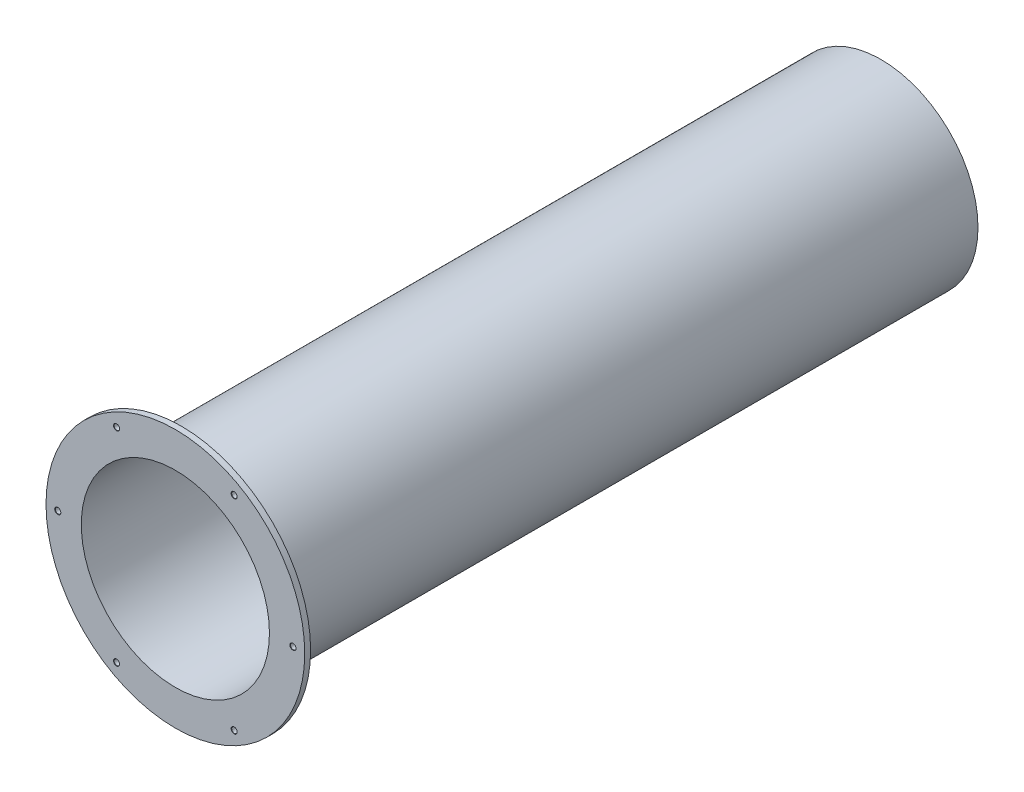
ISO-10303-21;
HEADER;
FILE_DESCRIPTION(('STEP AP214'),'2;1');
FILE_NAME('part.step','',(''),(''),'','','');
FILE_SCHEMA(('AUTOMOTIVE_DESIGN { 1 0 10303 214 1 1 1 1 }'));
ENDSEC;
DATA;
#1=APPLICATION_CONTEXT('core data for automotive mechanical design processes');
#2=APPLICATION_PROTOCOL_DEFINITION('international standard','automotive_design',2000,#1);
#3=PRODUCT_CONTEXT('',#1,'mechanical');
#4=PRODUCT('Part','Part','',(#3));
#5=PRODUCT_RELATED_PRODUCT_CATEGORY('part','',(#4));
#6=PRODUCT_DEFINITION_FORMATION('','',#4);
#7=PRODUCT_DEFINITION_CONTEXT('part definition',#1,'design');
#8=PRODUCT_DEFINITION('design','',#6,#7);
#9=PRODUCT_DEFINITION_SHAPE('','',#8);
#10=(LENGTH_UNIT() NAMED_UNIT(*) SI_UNIT(.MILLI.,.METRE.));
#11=(NAMED_UNIT(*) PLANE_ANGLE_UNIT() SI_UNIT($,.RADIAN.));
#12=(NAMED_UNIT(*) SI_UNIT($,.STERADIAN.) SOLID_ANGLE_UNIT());
#13=UNCERTAINTY_MEASURE_WITH_UNIT(LENGTH_MEASURE(1.E-05),#10,'distance_accuracy_value','');
#14=(GEOMETRIC_REPRESENTATION_CONTEXT(3) GLOBAL_UNCERTAINTY_ASSIGNED_CONTEXT((#13)) GLOBAL_UNIT_ASSIGNED_CONTEXT((#10,
#11,#12)) REPRESENTATION_CONTEXT('',''));
#15=CARTESIAN_POINT('',(0.,0.,0.));
#16=DIRECTION('',(0.,0.,1.));
#17=DIRECTION('',(1.,0.,0.));
#18=AXIS2_PLACEMENT_3D('',#15,#16,#17);
#19=CARTESIAN_POINT('',(0.,0.,12.7));
#20=DIRECTION('',(0.,0.,1.));
#21=DIRECTION('',(1.,0.,0.));
#22=AXIS2_PLACEMENT_3D('',#19,#20,#21);
#23=PLANE('',#22);
#24=CARTESIAN_POINT('',(254.,0.,12.7));
#25=DIRECTION('',(0.,0.,1.));
#26=DIRECTION('',(1.,0.,0.));
#27=AXIS2_PLACEMENT_3D('',#24,#25,#26);
#28=CIRCLE('',#27,6.588125);
#29=CARTESIAN_POINT('',(260.588125,0.,12.7));
#30=VERTEX_POINT('',#29);
#31=EDGE_CURVE('E123',#30,#30,#28,.T.);
#32=ORIENTED_EDGE('',*,*,#31,.F.);
#33=EDGE_LOOP('',(#32));
#34=FACE_BOUND('',#33,.T.);
#35=CARTESIAN_POINT('',(127.,-219.970452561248,12.7));
#36=DIRECTION('',(0.,0.,1.));
#37=DIRECTION('',(1.,0.,0.));
#38=AXIS2_PLACEMENT_3D('',#35,#36,#37);
#39=CIRCLE('',#38,6.588125);
#40=CARTESIAN_POINT('',(133.588125,-219.970452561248,12.7));
#41=VERTEX_POINT('',#40);
#42=EDGE_CURVE('E111',#41,#41,#39,.T.);
#43=ORIENTED_EDGE('',*,*,#42,.F.);
#44=EDGE_LOOP('',(#43));
#45=FACE_BOUND('',#44,.T.);
#46=CARTESIAN_POINT('',(-127.000000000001,-219.970452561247,12.7));
#47=DIRECTION('',(0.,0.,1.));
#48=DIRECTION('',(1.,0.,0.));
#49=AXIS2_PLACEMENT_3D('',#46,#47,#48);
#50=CIRCLE('',#49,6.588125);
#51=CARTESIAN_POINT('',(-120.411875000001,-219.970452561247,12.7));
#52=VERTEX_POINT('',#51);
#53=EDGE_CURVE('E99',#52,#52,#50,.T.);
#54=ORIENTED_EDGE('',*,*,#53,.F.);
#55=EDGE_LOOP('',(#54));
#56=FACE_BOUND('',#55,.T.);
#57=CARTESIAN_POINT('',(-254.,1.77367252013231E-12,12.7));
#58=DIRECTION('',(0.,0.,1.));
#59=DIRECTION('',(1.,0.,0.));
#60=AXIS2_PLACEMENT_3D('',#57,#58,#59);
#61=CIRCLE('',#60,6.588125);
#62=CARTESIAN_POINT('',(-247.411875,1.77367252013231E-12,12.7));
#63=VERTEX_POINT('',#62);
#64=EDGE_CURVE('E87',#63,#63,#61,.T.);
#65=ORIENTED_EDGE('',*,*,#64,.F.);
#66=EDGE_LOOP('',(#65));
#67=FACE_BOUND('',#66,.T.);
#68=CARTESIAN_POINT('',(-126.999999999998,219.970452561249,12.7));
#69=DIRECTION('',(0.,0.,1.));
#70=DIRECTION('',(1.,0.,0.));
#71=AXIS2_PLACEMENT_3D('',#68,#69,#70);
#72=CIRCLE('',#71,6.588125);
#73=CARTESIAN_POINT('',(-120.411874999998,219.970452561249,12.7));
#74=VERTEX_POINT('',#73);
#75=EDGE_CURVE('E75',#74,#74,#72,.T.);
#76=ORIENTED_EDGE('',*,*,#75,.F.);
#77=EDGE_LOOP('',(#76));
#78=FACE_BOUND('',#77,.T.);
#79=CARTESIAN_POINT('',(127.000000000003,219.970452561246,12.7));
#80=DIRECTION('',(0.,0.,1.));
#81=DIRECTION('',(1.,0.,0.));
#82=AXIS2_PLACEMENT_3D('',#79,#80,#81);
#83=CIRCLE('',#82,6.588125);
#84=CARTESIAN_POINT('',(133.588125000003,219.970452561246,12.7));
#85=VERTEX_POINT('',#84);
#86=EDGE_CURVE('E63',#85,#85,#83,.T.);
#87=ORIENTED_EDGE('',*,*,#86,.F.);
#88=EDGE_LOOP('',(#87));
#89=FACE_BOUND('',#88,.T.);
#90=CARTESIAN_POINT('',(0.,0.,12.7));
#91=DIRECTION('',(0.,0.,1.));
#92=DIRECTION('',(1.,0.,0.));
#93=AXIS2_PLACEMENT_3D('',#90,#91,#92);
#94=CIRCLE('',#93,279.4);
#95=CARTESIAN_POINT('',(279.4,0.,12.7));
#96=VERTEX_POINT('',#95);
#97=EDGE_CURVE('E10',#96,#96,#94,.T.);
#98=ORIENTED_EDGE('',*,*,#97,.T.);
#99=EDGE_LOOP('',(#98));
#100=FACE_BOUND('',#99,.T.);
#101=CARTESIAN_POINT('',(0.,0.,12.7));
#102=DIRECTION('',(0.,0.,1.));
#103=DIRECTION('',(1.,0.,0.));
#104=AXIS2_PLACEMENT_3D('',#101,#102,#103);
#105=CIRCLE('',#104,203.2);
#106=CARTESIAN_POINT('',(203.2,0.,12.7));
#107=VERTEX_POINT('',#106);
#108=EDGE_CURVE('E47',#107,#107,#105,.T.);
#109=ORIENTED_EDGE('',*,*,#108,.F.);
#110=EDGE_LOOP('',(#109));
#111=FACE_BOUND('',#110,.T.);
#112=ADVANCED_FACE('F34',(#34,#45,#56,#67,#78,#89,#100,#111),#23,.T.);
#113=CARTESIAN_POINT('',(0.,0.,0.));
#114=DIRECTION('',(0.,0.,1.));
#115=DIRECTION('',(1.,0.,0.));
#116=AXIS2_PLACEMENT_3D('',#113,#114,#115);
#117=PLANE('',#116);
#118=CARTESIAN_POINT('',(254.,0.,0.));
#119=DIRECTION('',(0.,0.,1.));
#120=DIRECTION('',(1.,0.,0.));
#121=AXIS2_PLACEMENT_3D('',#118,#119,#120);
#122=CIRCLE('',#121,6.588125);
#123=CARTESIAN_POINT('',(260.588125,0.,0.));
#124=VERTEX_POINT('',#123);
#125=EDGE_CURVE('E126',#124,#124,#122,.T.);
#126=ORIENTED_EDGE('',*,*,#125,.T.);
#127=EDGE_LOOP('',(#126));
#128=FACE_BOUND('',#127,.T.);
#129=CARTESIAN_POINT('',(127.,-219.970452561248,0.));
#130=DIRECTION('',(0.,0.,1.));
#131=DIRECTION('',(1.,0.,0.));
#132=AXIS2_PLACEMENT_3D('',#129,#130,#131);
#133=CIRCLE('',#132,6.588125);
#134=CARTESIAN_POINT('',(133.588125,-219.970452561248,0.));
#135=VERTEX_POINT('',#134);
#136=EDGE_CURVE('E114',#135,#135,#133,.T.);
#137=ORIENTED_EDGE('',*,*,#136,.T.);
#138=EDGE_LOOP('',(#137));
#139=FACE_BOUND('',#138,.T.);
#140=CARTESIAN_POINT('',(-127.000000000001,-219.970452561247,0.));
#141=DIRECTION('',(0.,0.,1.));
#142=DIRECTION('',(1.,0.,0.));
#143=AXIS2_PLACEMENT_3D('',#140,#141,#142);
#144=CIRCLE('',#143,6.588125);
#145=CARTESIAN_POINT('',(-120.411875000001,-219.970452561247,0.));
#146=VERTEX_POINT('',#145);
#147=EDGE_CURVE('E102',#146,#146,#144,.T.);
#148=ORIENTED_EDGE('',*,*,#147,.T.);
#149=EDGE_LOOP('',(#148));
#150=FACE_BOUND('',#149,.T.);
#151=CARTESIAN_POINT('',(-254.,1.77367252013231E-12,0.));
#152=DIRECTION('',(0.,0.,1.));
#153=DIRECTION('',(1.,0.,0.));
#154=AXIS2_PLACEMENT_3D('',#151,#152,#153);
#155=CIRCLE('',#154,6.588125);
#156=CARTESIAN_POINT('',(-247.411875,1.77367252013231E-12,0.));
#157=VERTEX_POINT('',#156);
#158=EDGE_CURVE('E90',#157,#157,#155,.T.);
#159=ORIENTED_EDGE('',*,*,#158,.T.);
#160=EDGE_LOOP('',(#159));
#161=FACE_BOUND('',#160,.T.);
#162=CARTESIAN_POINT('',(-126.999999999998,219.970452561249,0.));
#163=DIRECTION('',(0.,0.,1.));
#164=DIRECTION('',(1.,0.,0.));
#165=AXIS2_PLACEMENT_3D('',#162,#163,#164);
#166=CIRCLE('',#165,6.588125);
#167=CARTESIAN_POINT('',(-120.411874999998,219.970452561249,0.));
#168=VERTEX_POINT('',#167);
#169=EDGE_CURVE('E78',#168,#168,#166,.T.);
#170=ORIENTED_EDGE('',*,*,#169,.T.);
#171=EDGE_LOOP('',(#170));
#172=FACE_BOUND('',#171,.T.);
#173=CARTESIAN_POINT('',(127.000000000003,219.970452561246,0.));
#174=DIRECTION('',(0.,0.,1.));
#175=DIRECTION('',(1.,0.,0.));
#176=AXIS2_PLACEMENT_3D('',#173,#174,#175);
#177=CIRCLE('',#176,6.588125);
#178=CARTESIAN_POINT('',(133.588125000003,219.970452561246,0.));
#179=VERTEX_POINT('',#178);
#180=EDGE_CURVE('E66',#179,#179,#177,.T.);
#181=ORIENTED_EDGE('',*,*,#180,.T.);
#182=EDGE_LOOP('',(#181));
#183=FACE_BOUND('',#182,.T.);
#184=CARTESIAN_POINT('',(0.,0.,0.));
#185=DIRECTION('',(0.,0.,1.));
#186=DIRECTION('',(1.,0.,0.));
#187=AXIS2_PLACEMENT_3D('',#184,#185,#186);
#188=CIRCLE('',#187,209.55);
#189=CARTESIAN_POINT('',(209.55,0.,0.));
#190=VERTEX_POINT('',#189);
#191=EDGE_CURVE('E38',#190,#190,#188,.T.);
#192=ORIENTED_EDGE('',*,*,#191,.T.);
#193=EDGE_LOOP('',(#192));
#194=FACE_BOUND('',#193,.T.);
#195=CARTESIAN_POINT('',(0.,0.,0.));
#196=DIRECTION('',(0.,0.,1.));
#197=DIRECTION('',(1.,0.,0.));
#198=AXIS2_PLACEMENT_3D('',#195,#196,#197);
#199=CIRCLE('',#198,279.4);
#200=CARTESIAN_POINT('',(279.4,0.,0.));
#201=VERTEX_POINT('',#200);
#202=EDGE_CURVE('E42',#201,#201,#199,.T.);
#203=ORIENTED_EDGE('',*,*,#202,.F.);
#204=EDGE_LOOP('',(#203));
#205=FACE_BOUND('',#204,.T.);
#206=ADVANCED_FACE('F130',(#128,#139,#150,#161,#172,#183,#194,#205),#117,.F.);
#207=CARTESIAN_POINT('',(0.,0.,12.7));
#208=DIRECTION('',(0.,0.,-1.));
#209=DIRECTION('',(-1.,0.,0.));
#210=AXIS2_PLACEMENT_3D('',#207,#208,#209);
#211=CYLINDRICAL_SURFACE('',#210,279.4);
#212=ORIENTED_EDGE('',*,*,#97,.F.);
#213=EDGE_LOOP('',(#212));
#214=FACE_BOUND('',#213,.T.);
#215=ORIENTED_EDGE('',*,*,#202,.T.);
#216=EDGE_LOOP('',(#215));
#217=FACE_BOUND('',#216,.T.);
#218=ADVANCED_FACE('F36',(#214,#217),#211,.T.);
#219=CARTESIAN_POINT('',(0.,0.,12.7));
#220=DIRECTION('',(0.,0.,-1.));
#221=DIRECTION('',(-1.,0.,0.));
#222=AXIS2_PLACEMENT_3D('',#219,#220,#221);
#223=CYLINDRICAL_SURFACE('',#222,203.2);
#224=ORIENTED_EDGE('',*,*,#108,.T.);
#225=EDGE_LOOP('',(#224));
#226=FACE_BOUND('',#225,.T.);
#227=CARTESIAN_POINT('',(0.,0.,-1511.3));
#228=DIRECTION('',(0.,0.,1.));
#229=DIRECTION('',(1.,0.,0.));
#230=AXIS2_PLACEMENT_3D('',#227,#228,#229);
#231=CIRCLE('',#230,203.2);
#232=CARTESIAN_POINT('',(203.2,0.,-1511.3));
#233=VERTEX_POINT('',#232);
#234=EDGE_CURVE('E54',#233,#233,#231,.T.);
#235=ORIENTED_EDGE('',*,*,#234,.F.);
#236=EDGE_LOOP('',(#235));
#237=FACE_BOUND('',#236,.T.);
#238=ADVANCED_FACE('F167',(#226,#237),#223,.F.);
#239=CARTESIAN_POINT('',(0.,0.,-1511.3));
#240=DIRECTION('',(0.,0.,1.));
#241=DIRECTION('',(1.,0.,0.));
#242=AXIS2_PLACEMENT_3D('',#239,#240,#241);
#243=CYLINDRICAL_SURFACE('',#242,209.55);
#244=CARTESIAN_POINT('',(0.,0.,-1511.3));
#245=DIRECTION('',(0.,0.,1.));
#246=DIRECTION('',(1.,0.,0.));
#247=AXIS2_PLACEMENT_3D('',#244,#245,#246);
#248=CIRCLE('',#247,209.55);
#249=CARTESIAN_POINT('',(209.55,0.,-1511.3));
#250=VERTEX_POINT('',#249);
#251=EDGE_CURVE('E51',#250,#250,#248,.T.);
#252=ORIENTED_EDGE('',*,*,#251,.T.);
#253=EDGE_LOOP('',(#252));
#254=FACE_BOUND('',#253,.T.);
#255=ORIENTED_EDGE('',*,*,#191,.F.);
#256=EDGE_LOOP('',(#255));
#257=FACE_BOUND('',#256,.T.);
#258=ADVANCED_FACE('F170',(#254,#257),#243,.T.);
#259=CARTESIAN_POINT('',(0.,0.,-1511.3));
#260=DIRECTION('',(0.,0.,1.));
#261=DIRECTION('',(1.,0.,0.));
#262=AXIS2_PLACEMENT_3D('',#259,#260,#261);
#263=PLANE('',#262);
#264=ORIENTED_EDGE('',*,*,#234,.T.);
#265=EDGE_LOOP('',(#264));
#266=FACE_BOUND('',#265,.T.);
#267=ORIENTED_EDGE('',*,*,#251,.F.);
#268=EDGE_LOOP('',(#267));
#269=FACE_BOUND('',#268,.T.);
#270=ADVANCED_FACE('F174',(#266,#269),#263,.F.);
#271=CARTESIAN_POINT('',(127.000000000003,219.970452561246,0.635000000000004));
#272=DIRECTION('',(0.,0.,-1.));
#273=DIRECTION('',(-1.,0.,0.));
#274=AXIS2_PLACEMENT_3D('',#271,#272,#273);
#275=CONICAL_SURFACE('',#274,5.953125,0.785398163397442);
#276=ORIENTED_EDGE('',*,*,#180,.F.);
#277=EDGE_LOOP('',(#276));
#278=FACE_BOUND('',#277,.T.);
#279=CARTESIAN_POINT('',(127.000000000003,219.970452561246,0.635000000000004));
#280=DIRECTION('',(0.,0.,1.));
#281=DIRECTION('',(1.,0.,0.));
#282=AXIS2_PLACEMENT_3D('',#279,#280,#281);
#283=CIRCLE('',#282,5.953125);
#284=CARTESIAN_POINT('',(132.953125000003,219.970452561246,0.635000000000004));
#285=VERTEX_POINT('',#284);
#286=EDGE_CURVE('E57',#285,#285,#283,.T.);
#287=ORIENTED_EDGE('',*,*,#286,.T.);
#288=EDGE_LOOP('',(#287));
#289=FACE_BOUND('',#288,.T.);
#290=ADVANCED_FACE('F177',(#278,#289),#275,.F.);
#291=CARTESIAN_POINT('',(127.000000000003,219.970452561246,12.7));
#292=DIRECTION('',(0.,0.,1.));
#293=DIRECTION('',(1.,0.,0.));
#294=AXIS2_PLACEMENT_3D('',#291,#292,#293);
#295=CYLINDRICAL_SURFACE('',#294,5.953125);
#296=ORIENTED_EDGE('',*,*,#286,.F.);
#297=EDGE_LOOP('',(#296));
#298=FACE_BOUND('',#297,.T.);
#299=CARTESIAN_POINT('',(127.000000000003,219.970452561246,12.065));
#300=DIRECTION('',(0.,0.,1.));
#301=DIRECTION('',(1.,0.,0.));
#302=AXIS2_PLACEMENT_3D('',#299,#300,#301);
#303=CIRCLE('',#302,5.953125);
#304=CARTESIAN_POINT('',(132.953125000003,219.970452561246,12.065));
#305=VERTEX_POINT('',#304);
#306=EDGE_CURVE('E60',#305,#305,#303,.T.);
#307=ORIENTED_EDGE('',*,*,#306,.T.);
#308=EDGE_LOOP('',(#307));
#309=FACE_BOUND('',#308,.T.);
#310=ADVANCED_FACE('F216',(#298,#309),#295,.F.);
#311=CARTESIAN_POINT('',(127.000000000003,219.970452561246,12.7));
#312=DIRECTION('',(0.,0.,1.));
#313=DIRECTION('',(1.,0.,0.));
#314=AXIS2_PLACEMENT_3D('',#311,#312,#313);
#315=CONICAL_SURFACE('',#314,6.588125,0.785398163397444);
#316=ORIENTED_EDGE('',*,*,#306,.F.);
#317=EDGE_LOOP('',(#316));
#318=FACE_BOUND('',#317,.T.);
#319=ORIENTED_EDGE('',*,*,#86,.T.);
#320=EDGE_LOOP('',(#319));
#321=FACE_BOUND('',#320,.T.);
#322=ADVANCED_FACE('F224',(#318,#321),#315,.F.);
#323=CARTESIAN_POINT('',(-126.999999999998,219.970452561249,0.635000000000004));
#324=DIRECTION('',(0.,0.,-1.));
#325=DIRECTION('',(-1.,0.,0.));
#326=AXIS2_PLACEMENT_3D('',#323,#324,#325);
#327=CONICAL_SURFACE('',#326,5.953125,0.785398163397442);
#328=ORIENTED_EDGE('',*,*,#169,.F.);
#329=EDGE_LOOP('',(#328));
#330=FACE_BOUND('',#329,.T.);
#331=CARTESIAN_POINT('',(-126.999999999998,219.970452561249,0.635000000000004));
#332=DIRECTION('',(0.,0.,1.));
#333=DIRECTION('',(1.,0.,0.));
#334=AXIS2_PLACEMENT_3D('',#331,#332,#333);
#335=CIRCLE('',#334,5.953125);
#336=CARTESIAN_POINT('',(-121.046874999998,219.970452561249,0.635000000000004));
#337=VERTEX_POINT('',#336);
#338=EDGE_CURVE('E69',#337,#337,#335,.T.);
#339=ORIENTED_EDGE('',*,*,#338,.T.);
#340=EDGE_LOOP('',(#339));
#341=FACE_BOUND('',#340,.T.);
#342=ADVANCED_FACE('F232',(#330,#341),#327,.F.);
#343=CARTESIAN_POINT('',(-126.999999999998,219.970452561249,12.7));
#344=DIRECTION('',(0.,0.,1.));
#345=DIRECTION('',(1.,0.,0.));
#346=AXIS2_PLACEMENT_3D('',#343,#344,#345);
#347=CYLINDRICAL_SURFACE('',#346,5.953125);
#348=ORIENTED_EDGE('',*,*,#338,.F.);
#349=EDGE_LOOP('',(#348));
#350=FACE_BOUND('',#349,.T.);
#351=CARTESIAN_POINT('',(-126.999999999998,219.970452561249,12.065));
#352=DIRECTION('',(0.,0.,1.));
#353=DIRECTION('',(1.,0.,0.));
#354=AXIS2_PLACEMENT_3D('',#351,#352,#353);
#355=CIRCLE('',#354,5.953125);
#356=CARTESIAN_POINT('',(-121.046874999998,219.970452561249,12.065));
#357=VERTEX_POINT('',#356);
#358=EDGE_CURVE('E72',#357,#357,#355,.T.);
#359=ORIENTED_EDGE('',*,*,#358,.T.);
#360=EDGE_LOOP('',(#359));
#361=FACE_BOUND('',#360,.T.);
#362=ADVANCED_FACE('F240',(#350,#361),#347,.F.);
#363=CARTESIAN_POINT('',(-126.999999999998,219.970452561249,12.7));
#364=DIRECTION('',(0.,0.,1.));
#365=DIRECTION('',(1.,0.,0.));
#366=AXIS2_PLACEMENT_3D('',#363,#364,#365);
#367=CONICAL_SURFACE('',#366,6.588125,0.785398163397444);
#368=ORIENTED_EDGE('',*,*,#358,.F.);
#369=EDGE_LOOP('',(#368));
#370=FACE_BOUND('',#369,.T.);
#371=ORIENTED_EDGE('',*,*,#75,.T.);
#372=EDGE_LOOP('',(#371));
#373=FACE_BOUND('',#372,.T.);
#374=ADVANCED_FACE('F248',(#370,#373),#367,.F.);
#375=CARTESIAN_POINT('',(-254.,1.77367252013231E-12,0.635000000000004));
#376=DIRECTION('',(0.,0.,-1.));
#377=DIRECTION('',(-1.,0.,0.));
#378=AXIS2_PLACEMENT_3D('',#375,#376,#377);
#379=CONICAL_SURFACE('',#378,5.953125,0.785398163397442);
#380=ORIENTED_EDGE('',*,*,#158,.F.);
#381=EDGE_LOOP('',(#380));
#382=FACE_BOUND('',#381,.T.);
#383=CARTESIAN_POINT('',(-254.,1.77367252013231E-12,0.635000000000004));
#384=DIRECTION('',(0.,0.,1.));
#385=DIRECTION('',(1.,0.,0.));
#386=AXIS2_PLACEMENT_3D('',#383,#384,#385);
#387=CIRCLE('',#386,5.953125);
#388=CARTESIAN_POINT('',(-248.046875,1.77367252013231E-12,0.635000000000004));
#389=VERTEX_POINT('',#388);
#390=EDGE_CURVE('E81',#389,#389,#387,.T.);
#391=ORIENTED_EDGE('',*,*,#390,.T.);
#392=EDGE_LOOP('',(#391));
#393=FACE_BOUND('',#392,.T.);
#394=ADVANCED_FACE('F256',(#382,#393),#379,.F.);
#395=CARTESIAN_POINT('',(-254.,1.77367252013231E-12,12.7));
#396=DIRECTION('',(0.,0.,1.));
#397=DIRECTION('',(1.,0.,0.));
#398=AXIS2_PLACEMENT_3D('',#395,#396,#397);
#399=CYLINDRICAL_SURFACE('',#398,5.953125);
#400=ORIENTED_EDGE('',*,*,#390,.F.);
#401=EDGE_LOOP('',(#400));
#402=FACE_BOUND('',#401,.T.);
#403=CARTESIAN_POINT('',(-254.,1.77367252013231E-12,12.065));
#404=DIRECTION('',(0.,0.,1.));
#405=DIRECTION('',(1.,0.,0.));
#406=AXIS2_PLACEMENT_3D('',#403,#404,#405);
#407=CIRCLE('',#406,5.953125);
#408=CARTESIAN_POINT('',(-248.046875,1.77367252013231E-12,12.065));
#409=VERTEX_POINT('',#408);
#410=EDGE_CURVE('E84',#409,#409,#407,.T.);
#411=ORIENTED_EDGE('',*,*,#410,.T.);
#412=EDGE_LOOP('',(#411));
#413=FACE_BOUND('',#412,.T.);
#414=ADVANCED_FACE('F264',(#402,#413),#399,.F.);
#415=CARTESIAN_POINT('',(-254.,1.77367252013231E-12,12.7));
#416=DIRECTION('',(0.,0.,1.));
#417=DIRECTION('',(1.,0.,0.));
#418=AXIS2_PLACEMENT_3D('',#415,#416,#417);
#419=CONICAL_SURFACE('',#418,6.588125,0.785398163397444);
#420=ORIENTED_EDGE('',*,*,#410,.F.);
#421=EDGE_LOOP('',(#420));
#422=FACE_BOUND('',#421,.T.);
#423=ORIENTED_EDGE('',*,*,#64,.T.);
#424=EDGE_LOOP('',(#423));
#425=FACE_BOUND('',#424,.T.);
#426=ADVANCED_FACE('F272',(#422,#425),#419,.F.);
#427=CARTESIAN_POINT('',(-127.000000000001,-219.970452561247,0.635000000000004));
#428=DIRECTION('',(0.,0.,-1.));
#429=DIRECTION('',(-1.,0.,0.));
#430=AXIS2_PLACEMENT_3D('',#427,#428,#429);
#431=CONICAL_SURFACE('',#430,5.953125,0.785398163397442);
#432=ORIENTED_EDGE('',*,*,#147,.F.);
#433=EDGE_LOOP('',(#432));
#434=FACE_BOUND('',#433,.T.);
#435=CARTESIAN_POINT('',(-127.000000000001,-219.970452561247,0.635000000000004));
#436=DIRECTION('',(0.,0.,1.));
#437=DIRECTION('',(1.,0.,0.));
#438=AXIS2_PLACEMENT_3D('',#435,#436,#437);
#439=CIRCLE('',#438,5.953125);
#440=CARTESIAN_POINT('',(-121.046875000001,-219.970452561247,0.635000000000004));
#441=VERTEX_POINT('',#440);
#442=EDGE_CURVE('E93',#441,#441,#439,.T.);
#443=ORIENTED_EDGE('',*,*,#442,.T.);
#444=EDGE_LOOP('',(#443));
#445=FACE_BOUND('',#444,.T.);
#446=ADVANCED_FACE('F280',(#434,#445),#431,.F.);
#447=CARTESIAN_POINT('',(-127.000000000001,-219.970452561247,12.7));
#448=DIRECTION('',(0.,0.,1.));
#449=DIRECTION('',(1.,0.,0.));
#450=AXIS2_PLACEMENT_3D('',#447,#448,#449);
#451=CYLINDRICAL_SURFACE('',#450,5.953125);
#452=ORIENTED_EDGE('',*,*,#442,.F.);
#453=EDGE_LOOP('',(#452));
#454=FACE_BOUND('',#453,.T.);
#455=CARTESIAN_POINT('',(-127.000000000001,-219.970452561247,12.065));
#456=DIRECTION('',(0.,0.,1.));
#457=DIRECTION('',(1.,0.,0.));
#458=AXIS2_PLACEMENT_3D('',#455,#456,#457);
#459=CIRCLE('',#458,5.953125);
#460=CARTESIAN_POINT('',(-121.046875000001,-219.970452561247,12.065));
#461=VERTEX_POINT('',#460);
#462=EDGE_CURVE('E96',#461,#461,#459,.T.);
#463=ORIENTED_EDGE('',*,*,#462,.T.);
#464=EDGE_LOOP('',(#463));
#465=FACE_BOUND('',#464,.T.);
#466=ADVANCED_FACE('F288',(#454,#465),#451,.F.);
#467=CARTESIAN_POINT('',(-127.000000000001,-219.970452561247,12.7));
#468=DIRECTION('',(0.,0.,1.));
#469=DIRECTION('',(1.,0.,0.));
#470=AXIS2_PLACEMENT_3D('',#467,#468,#469);
#471=CONICAL_SURFACE('',#470,6.588125,0.785398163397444);
#472=ORIENTED_EDGE('',*,*,#462,.F.);
#473=EDGE_LOOP('',(#472));
#474=FACE_BOUND('',#473,.T.);
#475=ORIENTED_EDGE('',*,*,#53,.T.);
#476=EDGE_LOOP('',(#475));
#477=FACE_BOUND('',#476,.T.);
#478=ADVANCED_FACE('F296',(#474,#477),#471,.F.);
#479=CARTESIAN_POINT('',(127.,-219.970452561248,0.635000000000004));
#480=DIRECTION('',(0.,0.,-1.));
#481=DIRECTION('',(-1.,0.,0.));
#482=AXIS2_PLACEMENT_3D('',#479,#480,#481);
#483=CONICAL_SURFACE('',#482,5.953125,0.785398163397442);
#484=ORIENTED_EDGE('',*,*,#136,.F.);
#485=EDGE_LOOP('',(#484));
#486=FACE_BOUND('',#485,.T.);
#487=CARTESIAN_POINT('',(127.,-219.970452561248,0.635000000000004));
#488=DIRECTION('',(0.,0.,1.));
#489=DIRECTION('',(1.,0.,0.));
#490=AXIS2_PLACEMENT_3D('',#487,#488,#489);
#491=CIRCLE('',#490,5.953125);
#492=CARTESIAN_POINT('',(132.953125,-219.970452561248,0.635000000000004));
#493=VERTEX_POINT('',#492);
#494=EDGE_CURVE('E105',#493,#493,#491,.T.);
#495=ORIENTED_EDGE('',*,*,#494,.T.);
#496=EDGE_LOOP('',(#495));
#497=FACE_BOUND('',#496,.T.);
#498=ADVANCED_FACE('F304',(#486,#497),#483,.F.);
#499=CARTESIAN_POINT('',(127.,-219.970452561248,12.7));
#500=DIRECTION('',(0.,0.,1.));
#501=DIRECTION('',(1.,0.,0.));
#502=AXIS2_PLACEMENT_3D('',#499,#500,#501);
#503=CYLINDRICAL_SURFACE('',#502,5.953125);
#504=ORIENTED_EDGE('',*,*,#494,.F.);
#505=EDGE_LOOP('',(#504));
#506=FACE_BOUND('',#505,.T.);
#507=CARTESIAN_POINT('',(127.,-219.970452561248,12.065));
#508=DIRECTION('',(0.,0.,1.));
#509=DIRECTION('',(1.,0.,0.));
#510=AXIS2_PLACEMENT_3D('',#507,#508,#509);
#511=CIRCLE('',#510,5.953125);
#512=CARTESIAN_POINT('',(132.953125,-219.970452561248,12.065));
#513=VERTEX_POINT('',#512);
#514=EDGE_CURVE('E108',#513,#513,#511,.T.);
#515=ORIENTED_EDGE('',*,*,#514,.T.);
#516=EDGE_LOOP('',(#515));
#517=FACE_BOUND('',#516,.T.);
#518=ADVANCED_FACE('F312',(#506,#517),#503,.F.);
#519=CARTESIAN_POINT('',(127.,-219.970452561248,12.7));
#520=DIRECTION('',(0.,0.,1.));
#521=DIRECTION('',(1.,0.,0.));
#522=AXIS2_PLACEMENT_3D('',#519,#520,#521);
#523=CONICAL_SURFACE('',#522,6.588125,0.785398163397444);
#524=ORIENTED_EDGE('',*,*,#514,.F.);
#525=EDGE_LOOP('',(#524));
#526=FACE_BOUND('',#525,.T.);
#527=ORIENTED_EDGE('',*,*,#42,.T.);
#528=EDGE_LOOP('',(#527));
#529=FACE_BOUND('',#528,.T.);
#530=ADVANCED_FACE('F137',(#526,#529),#523,.F.);
#531=CARTESIAN_POINT('',(254.,0.,0.635000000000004));
#532=DIRECTION('',(0.,0.,-1.));
#533=DIRECTION('',(-1.,0.,0.));
#534=AXIS2_PLACEMENT_3D('',#531,#532,#533);
#535=CONICAL_SURFACE('',#534,5.953125,0.785398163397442);
#536=ORIENTED_EDGE('',*,*,#125,.F.);
#537=EDGE_LOOP('',(#536));
#538=FACE_BOUND('',#537,.T.);
#539=CARTESIAN_POINT('',(254.,0.,0.635000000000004));
#540=DIRECTION('',(0.,0.,1.));
#541=DIRECTION('',(1.,0.,0.));
#542=AXIS2_PLACEMENT_3D('',#539,#540,#541);
#543=CIRCLE('',#542,5.953125);
#544=CARTESIAN_POINT('',(259.953125,0.,0.635000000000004));
#545=VERTEX_POINT('',#544);
#546=EDGE_CURVE('E117',#545,#545,#543,.T.);
#547=ORIENTED_EDGE('',*,*,#546,.T.);
#548=EDGE_LOOP('',(#547));
#549=FACE_BOUND('',#548,.T.);
#550=ADVANCED_FACE('F133',(#538,#549),#535,.F.);
#551=CARTESIAN_POINT('',(254.,0.,12.7));
#552=DIRECTION('',(0.,0.,1.));
#553=DIRECTION('',(1.,0.,0.));
#554=AXIS2_PLACEMENT_3D('',#551,#552,#553);
#555=CYLINDRICAL_SURFACE('',#554,5.953125);
#556=ORIENTED_EDGE('',*,*,#546,.F.);
#557=EDGE_LOOP('',(#556));
#558=FACE_BOUND('',#557,.T.);
#559=CARTESIAN_POINT('',(254.,0.,12.065));
#560=DIRECTION('',(0.,0.,1.));
#561=DIRECTION('',(1.,0.,0.));
#562=AXIS2_PLACEMENT_3D('',#559,#560,#561);
#563=CIRCLE('',#562,5.953125);
#564=CARTESIAN_POINT('',(259.953125,0.,12.065));
#565=VERTEX_POINT('',#564);
#566=EDGE_CURVE('E120',#565,#565,#563,.T.);
#567=ORIENTED_EDGE('',*,*,#566,.T.);
#568=EDGE_LOOP('',(#567));
#569=FACE_BOUND('',#568,.T.);
#570=ADVANCED_FACE('F136',(#558,#569),#555,.F.);
#571=CARTESIAN_POINT('',(254.,0.,12.7));
#572=DIRECTION('',(0.,0.,1.));
#573=DIRECTION('',(1.,0.,0.));
#574=AXIS2_PLACEMENT_3D('',#571,#572,#573);
#575=CONICAL_SURFACE('',#574,6.588125,0.785398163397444);
#576=ORIENTED_EDGE('',*,*,#566,.F.);
#577=EDGE_LOOP('',(#576));
#578=FACE_BOUND('',#577,.T.);
#579=ORIENTED_EDGE('',*,*,#31,.T.);
#580=EDGE_LOOP('',(#579));
#581=FACE_BOUND('',#580,.T.);
#582=ADVANCED_FACE('F143',(#578,#581),#575,.F.);
#583=CLOSED_SHELL('',(#112,#206,#218,#238,#258,#270,#290,#310,#322,#342,#362,#374,#394,#414,
#426,#446,#466,#478,#498,#518,#530,#550,#570,#582));
#584=MANIFOLD_SOLID_BREP('B2',#583);
#585=ADVANCED_BREP_SHAPE_REPRESENTATION('',(#18,#584),#14);
#586=SHAPE_DEFINITION_REPRESENTATION(#9,#585);
ENDSEC;
END-ISO-10303-21;
